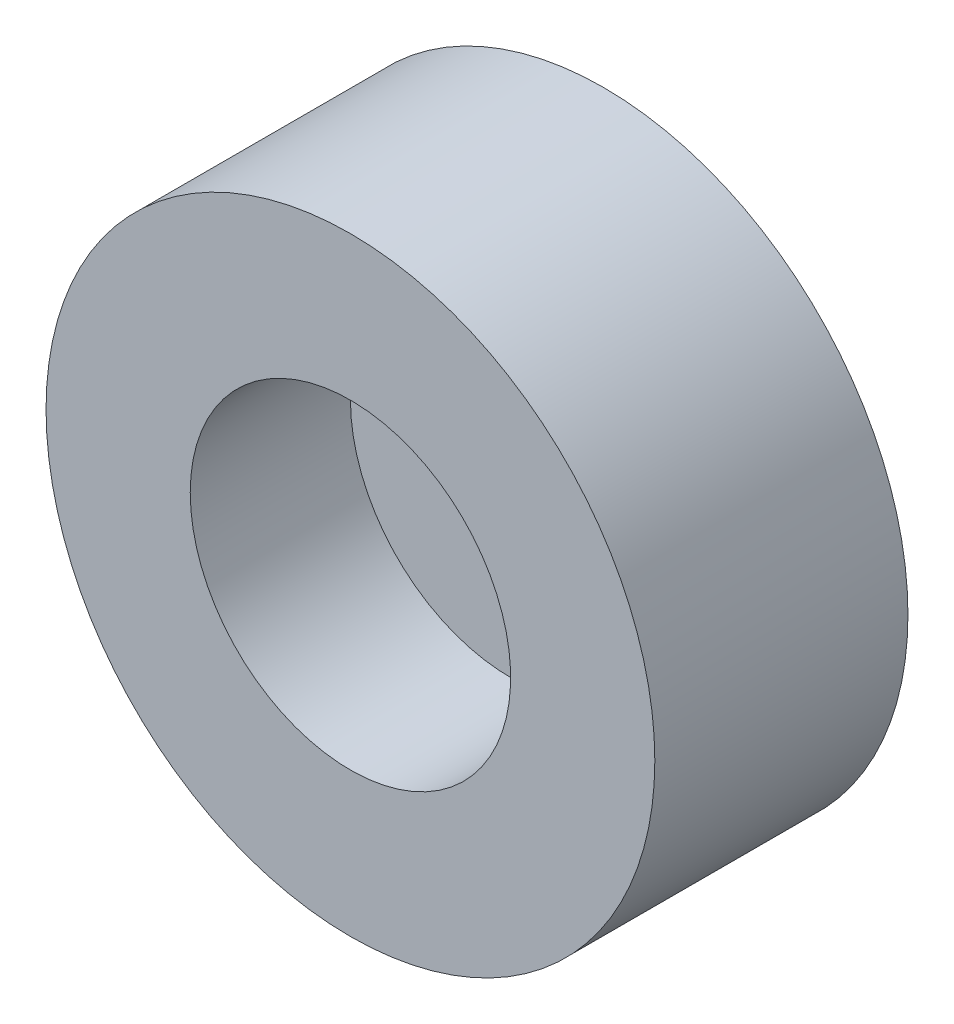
ISO-10303-21;
HEADER;
FILE_DESCRIPTION(('STEP AP214'),'2;1');
FILE_NAME('part.step','',(''),(''),'','','');
FILE_SCHEMA(('AUTOMOTIVE_DESIGN { 1 0 10303 214 1 1 1 1 }'));
ENDSEC;
DATA;
#1=APPLICATION_CONTEXT('core data for automotive mechanical design processes');
#2=APPLICATION_PROTOCOL_DEFINITION('international standard','automotive_design',2000,#1);
#3=PRODUCT_CONTEXT('',#1,'mechanical');
#4=PRODUCT('Part','Part','',(#3));
#5=PRODUCT_RELATED_PRODUCT_CATEGORY('part','',(#4));
#6=PRODUCT_DEFINITION_FORMATION('','',#4);
#7=PRODUCT_DEFINITION_CONTEXT('part definition',#1,'design');
#8=PRODUCT_DEFINITION('design','',#6,#7);
#9=PRODUCT_DEFINITION_SHAPE('','',#8);
#10=(LENGTH_UNIT() NAMED_UNIT(*) SI_UNIT(.MILLI.,.METRE.));
#11=(NAMED_UNIT(*) PLANE_ANGLE_UNIT() SI_UNIT($,.RADIAN.));
#12=(NAMED_UNIT(*) SI_UNIT($,.STERADIAN.) SOLID_ANGLE_UNIT());
#13=UNCERTAINTY_MEASURE_WITH_UNIT(LENGTH_MEASURE(1.E-05),#10,'distance_accuracy_value','');
#14=(GEOMETRIC_REPRESENTATION_CONTEXT(3) GLOBAL_UNCERTAINTY_ASSIGNED_CONTEXT((#13)) GLOBAL_UNIT_ASSIGNED_CONTEXT((#10,
#11,#12)) REPRESENTATION_CONTEXT('',''));
#15=CARTESIAN_POINT('',(0.,0.,0.));
#16=DIRECTION('',(0.,0.,1.));
#17=DIRECTION('',(1.,0.,0.));
#18=AXIS2_PLACEMENT_3D('',#15,#16,#17);
#19=CARTESIAN_POINT('',(2.35840467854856E-13,10.9999999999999,34.7700576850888));
#20=DIRECTION('',(0.,0.,-1.));
#21=DIRECTION('',(-1.,0.,0.));
#22=AXIS2_PLACEMENT_3D('',#19,#20,#21);
#23=CYLINDRICAL_SURFACE('',#22,5.);
#24=CARTESIAN_POINT('',(2.35840467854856E-13,10.9999999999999,7.9));
#25=DIRECTION('',(0.,0.,-1.));
#26=DIRECTION('',(-1.,0.,0.));
#27=AXIS2_PLACEMENT_3D('',#24,#25,#26);
#28=CIRCLE('',#27,5.);
#29=CARTESIAN_POINT('',(-4.99999999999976,10.9999999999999,7.9));
#30=VERTEX_POINT('',#29);
#31=EDGE_CURVE('E10',#30,#30,#28,.T.);
#32=ORIENTED_EDGE('',*,*,#31,.F.);
#33=EDGE_LOOP('',(#32));
#34=FACE_BOUND('',#33,.T.);
#35=CARTESIAN_POINT('',(1.49123756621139E-13,10.9999999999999,2.9));
#36=DIRECTION('',(0.,0.,-1.));
#37=DIRECTION('',(-0.78829695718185,0.615294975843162,0.));
#38=AXIS2_PLACEMENT_3D('',#35,#36,#37);
#39=CIRCLE('',#38,5.);
#40=CARTESIAN_POINT('',(-3.9414847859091,14.0764748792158,2.9));
#41=VERTEX_POINT('',#40);
#42=EDGE_CURVE('E47',#41,#41,#39,.T.);
#43=ORIENTED_EDGE('',*,*,#42,.T.);
#44=EDGE_LOOP('',(#43));
#45=FACE_BOUND('',#44,.T.);
#46=ADVANCED_FACE('F31',(#34,#45),#23,.F.);
#47=CARTESIAN_POINT('',(2.40362898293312E-13,10.9999999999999,0.));
#48=DIRECTION('',(0.,0.,1.));
#49=DIRECTION('',(1.,0.,0.));
#50=AXIS2_PLACEMENT_3D('',#47,#48,#49);
#51=PLANE('',#50);
#52=CARTESIAN_POINT('',(2.40362898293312E-13,10.9999999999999,0.));
#53=DIRECTION('',(0.,0.,1.));
#54=DIRECTION('',(1.,0.,0.));
#55=AXIS2_PLACEMENT_3D('',#52,#53,#54);
#56=CIRCLE('',#55,9.49999999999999);
#57=CARTESIAN_POINT('',(9.50000000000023,10.9999999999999,0.));
#58=VERTEX_POINT('',#57);
#59=EDGE_CURVE('E38',#58,#58,#56,.T.);
#60=ORIENTED_EDGE('',*,*,#59,.F.);
#61=EDGE_LOOP('',(#60));
#62=FACE_BOUND('',#61,.T.);
#63=ADVANCED_FACE('F62',(#62),#51,.F.);
#64=CARTESIAN_POINT('',(2.40362898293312E-13,10.9999999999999,34.7700576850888));
#65=DIRECTION('',(0.,0.,-1.));
#66=DIRECTION('',(-1.,0.,0.));
#67=AXIS2_PLACEMENT_3D('',#64,#65,#66);
#68=CYLINDRICAL_SURFACE('',#67,9.49999999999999);
#69=CARTESIAN_POINT('',(2.40362898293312E-13,10.9999999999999,7.9));
#70=DIRECTION('',(0.,0.,-1.));
#71=DIRECTION('',(-1.,0.,0.));
#72=AXIS2_PLACEMENT_3D('',#69,#70,#71);
#73=CIRCLE('',#72,9.49999999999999);
#74=CARTESIAN_POINT('',(-9.49999999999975,10.9999999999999,7.90000000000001));
#75=VERTEX_POINT('',#74);
#76=EDGE_CURVE('E42',#75,#75,#73,.T.);
#77=ORIENTED_EDGE('',*,*,#76,.T.);
#78=EDGE_LOOP('',(#77));
#79=FACE_BOUND('',#78,.T.);
#80=ORIENTED_EDGE('',*,*,#59,.T.);
#81=EDGE_LOOP('',(#80));
#82=FACE_BOUND('',#81,.T.);
#83=ADVANCED_FACE('F59',(#79,#82),#68,.T.);
#84=CARTESIAN_POINT('',(1.54350467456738E-13,11.,7.9));
#85=DIRECTION('',(0.,0.,-1.));
#86=DIRECTION('',(-0.78829695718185,0.615294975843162,0.));
#87=AXIS2_PLACEMENT_3D('',#84,#85,#86);
#88=PLANE('',#87);
#89=ORIENTED_EDGE('',*,*,#31,.T.);
#90=EDGE_LOOP('',(#89));
#91=FACE_BOUND('',#90,.T.);
#92=ORIENTED_EDGE('',*,*,#76,.F.);
#93=EDGE_LOOP('',(#92));
#94=FACE_BOUND('',#93,.T.);
#95=ADVANCED_FACE('F33',(#91,#94),#88,.F.);
#96=CARTESIAN_POINT('',(1.49123756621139E-13,10.9999999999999,2.9));
#97=DIRECTION('',(0.,0.,-1.));
#98=DIRECTION('',(-0.78829695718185,0.615294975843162,0.));
#99=AXIS2_PLACEMENT_3D('',#96,#97,#98);
#100=PLANE('',#99);
#101=ORIENTED_EDGE('',*,*,#42,.F.);
#102=EDGE_LOOP('',(#101));
#103=FACE_BOUND('',#102,.T.);
#104=ADVANCED_FACE('F53',(#103),#100,.F.);
#105=CLOSED_SHELL('',(#46,#63,#83,#95,#104));
#106=MANIFOLD_SOLID_BREP('B2',#105);
#107=ADVANCED_BREP_SHAPE_REPRESENTATION('',(#18,#106),#14);
#108=SHAPE_DEFINITION_REPRESENTATION(#9,#107);
ENDSEC;
END-ISO-10303-21;
